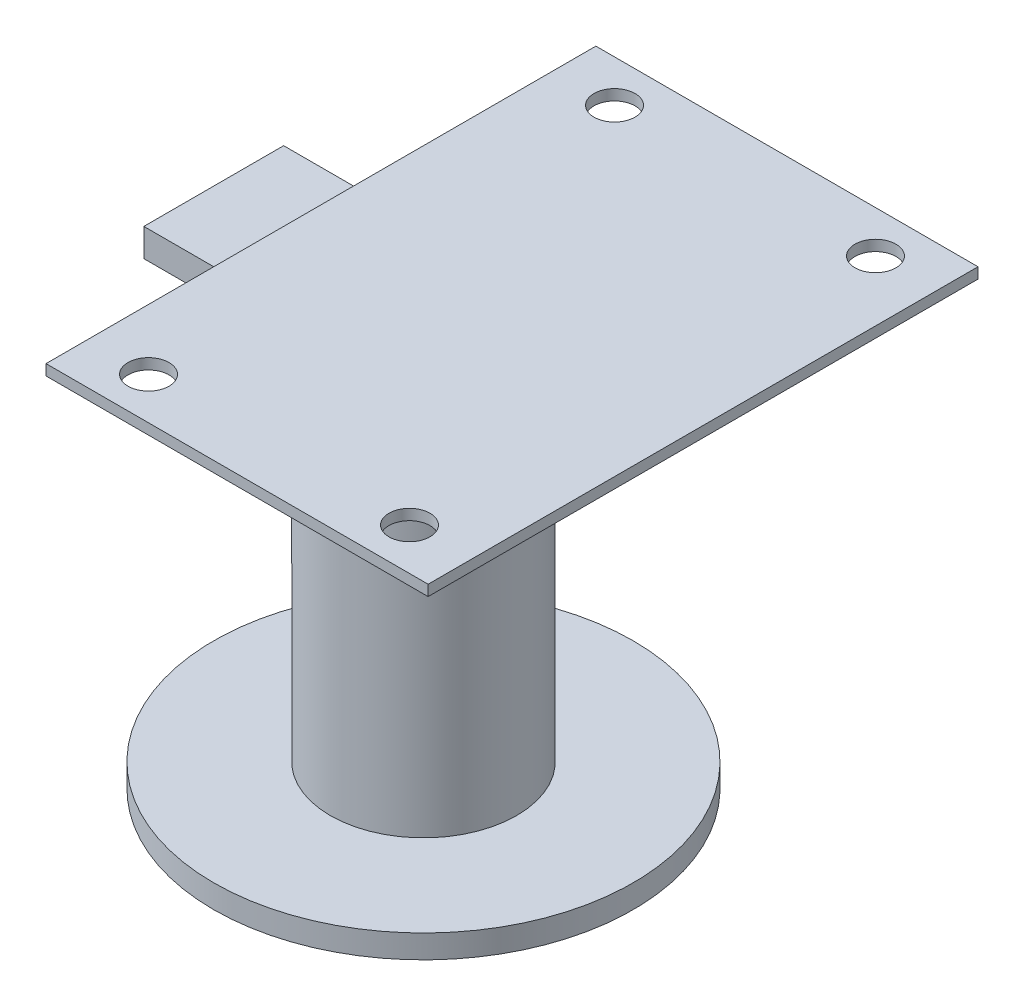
from build123d import *

# Parameters (mm, degrees)
SKIZZE1_W                       = 82
SKIZZE1_H                       = 118
AUFSATZ_LINEAR_AUSTRAGEN1_DEPTH = 2.3
SKIZZE2_R                       = 4.4
SCHNITT_LINEAR_AUSTRAGEN1_DEPTH = 72.883864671
SKIZZE3_R                       = 20
AUFSATZ_LINEAR_AUSTRAGEN2_DEPTH = 90.2
SKIZZE4_R                       = 45
AUFSATZ_LINEAR_AUSTRAGEN3_DEPTH = 5
AUFSATZ_LINEAR_AUSTRAGEN4_DEPTH = 15
WANDUNG1_T                      = -1


with BuildPart() as part:
    # Skizze1 → Aufsatz-Linear austragen1 (new body)
    with BuildSketch(Plane(origin=(0, 0, 0), x_dir=(1, 0, 0), z_dir=(0, 1, 0))):
        Rectangle(SKIZZE1_W, SKIZZE1_H)
    extrude(amount=-AUFSATZ_LINEAR_AUSTRAGEN1_DEPTH)

    # Skizze2 → Schnitt-Linear austragen1 (cut, through all)
    with BuildSketch(Plane(origin=(0, 0, 0), x_dir=(1, 0, 0), z_dir=(0, 1, 0))):
        with Locations(Location((-28, 50, 0), (0, 0, 270))):
            Circle(SKIZZE2_R)
        with Locations(Location((28, 50, 0), (0, 0, 270))):
            Circle(SKIZZE2_R)
        with Locations(Location((28, -50, 0), (0, 0, 270))):
            Circle(SKIZZE2_R)
        with Locations(Location((-28, -50, 0), (0, 0, 270))):
            Circle(SKIZZE2_R)
    extrude(amount=-SCHNITT_LINEAR_AUSTRAGEN1_DEPTH, mode=Mode.SUBTRACT)

    # Skizze3 → Aufsatz-Linear austragen2 (add)
    with BuildSketch(Plane.XZ.offset(2.3)):
        with Locations(Location((-19, 0, 0), (0, 0, 90))):
            Circle(SKIZZE3_R)
    extrude(amount=AUFSATZ_LINEAR_AUSTRAGEN2_DEPTH)

    # Skizze4 → Aufsatz-Linear austragen3 (add)
    with BuildSketch(Plane.XZ.offset(92.5)):
        with Locations(Location((-19, 0, 0), (0, 0, 90))):
            Circle(SKIZZE4_R)
    extrude(amount=AUFSATZ_LINEAR_AUSTRAGEN3_DEPTH)


with BuildPart() as body_2:
    # Skizze5 → Aufsatz-Linear austragen4 (new, symmetric)
    with BuildSketch(Plane.XY):
        Polygon((-39, -8), (-64, -8), (-64, -14), (-49, -14), (-19, -48), (-19, -8), align=None)
    extrude(amount=AUFSATZ_LINEAR_AUSTRAGEN4_DEPTH, both=True)

    # Wandung1
    wandung1_openings = [body_2.faces().sort_by_distance(p)[0] for p in [
        (-34, -31, 0),
        (-56.5, -14, 0),
        (-64, -11, 0),
    ]]
    offset(amount=WANDUNG1_T, openings=wandung1_openings, kind=Kind.INTERSECTION)

    # Kombinieren1: union part
    add(part.part)


solid = body_2.part
